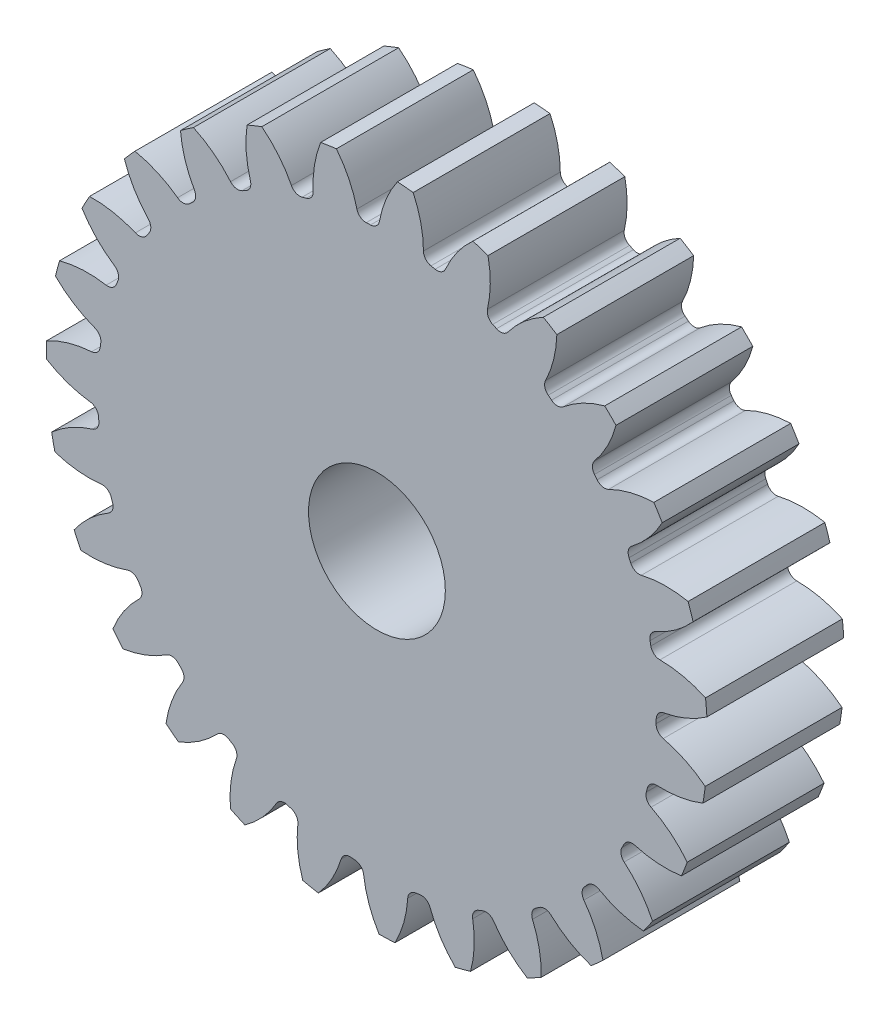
from build123d import *

# Parameters (mm, degrees)
SKETCH3_R         = 245.533333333
GEARBODY_DEPTH    = 101.6
TOOTHCUT_DEPTH    = 362.795239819
CIRPATTERN1_COUNT = 27
BOREDIA_R         = 50.8
BORE_DEPTH        = 12700


with BuildPart() as part:
    # Sketch3 → gearBody (new body)
    with BuildSketch(Plane.XY):
        Circle(SKETCH3_R)
    extrude(amount=GEARBODY_DEPTH)

    # Sketch2 → toothCut (cut, through all)
    with BuildSketch(Plane.XY):
        with BuildLine():
            ThreePointArc((207.304143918, -7.319815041), (207.35391807, -5.739376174), (207.391643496, -4.158603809))
            ThreePointArc((207.391643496, -4.158603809), (209.033106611, 0.169281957), (213.042261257, 2.482650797))
            ThreePointArc((213.042261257, 2.482650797), (230.044990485, 7.567484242), (245.533333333, 16.231176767))
            ThreePointArc((245.533333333, 16.231176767), (245.975029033, -6.808374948), (244.259556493, -29.788218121))
            ThreePointArc((244.259556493, -29.788218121), (229.274167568, -20.281039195), (212.578743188, -14.263470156))
            ThreePointArc((212.578743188, -14.263470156), (208.703692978, -11.731873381), (207.304143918, -7.319815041))
        make_face()
    toothcut = extrude(amount=TOOTHCUT_DEPTH, mode=Mode.SUBTRACT)

    # CirPattern1: toothCut ×27 about axis
    cirpattern1_axis = Axis((0, 0, 0), (0, 0, 1))
    for i in range(1, CIRPATTERN1_COUNT):
        add(toothcut.rotate(cirpattern1_axis, i * 360 / CIRPATTERN1_COUNT), mode=Mode.SUBTRACT)

    # boreDia → bore (cut, symmetric)
    with BuildSketch(Plane.XY):
        Circle(BOREDIA_R)
    extrude(amount=BORE_DEPTH, both=True, mode=Mode.SUBTRACT)


solid = part.part
